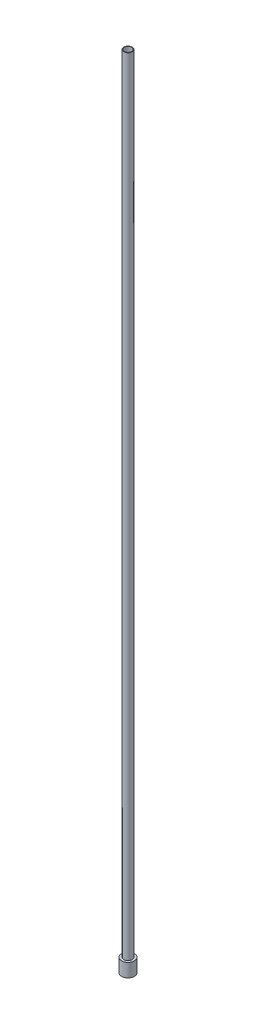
ISO-10303-21;
HEADER;
FILE_DESCRIPTION(('STEP AP214'),'2;1');
FILE_NAME('part.step','',(''),(''),'','','');
FILE_SCHEMA(('AUTOMOTIVE_DESIGN { 1 0 10303 214 1 1 1 1 }'));
ENDSEC;
DATA;
#1=APPLICATION_CONTEXT('core data for automotive mechanical design processes');
#2=APPLICATION_PROTOCOL_DEFINITION('international standard','automotive_design',2000,#1);
#3=PRODUCT_CONTEXT('',#1,'mechanical');
#4=PRODUCT('Part','Part','',(#3));
#5=PRODUCT_RELATED_PRODUCT_CATEGORY('part','',(#4));
#6=PRODUCT_DEFINITION_FORMATION('','',#4);
#7=PRODUCT_DEFINITION_CONTEXT('part definition',#1,'design');
#8=PRODUCT_DEFINITION('design','',#6,#7);
#9=PRODUCT_DEFINITION_SHAPE('','',#8);
#10=(LENGTH_UNIT() NAMED_UNIT(*) SI_UNIT(.MILLI.,.METRE.));
#11=(NAMED_UNIT(*) PLANE_ANGLE_UNIT() SI_UNIT($,.RADIAN.));
#12=(NAMED_UNIT(*) SI_UNIT($,.STERADIAN.) SOLID_ANGLE_UNIT());
#13=UNCERTAINTY_MEASURE_WITH_UNIT(LENGTH_MEASURE(1.E-05),#10,'distance_accuracy_value','');
#14=(GEOMETRIC_REPRESENTATION_CONTEXT(3) GLOBAL_UNCERTAINTY_ASSIGNED_CONTEXT((#13)) GLOBAL_UNIT_ASSIGNED_CONTEXT((#10,
#11,#12)) REPRESENTATION_CONTEXT('',''));
#15=CARTESIAN_POINT('',(0.,0.,0.));
#16=DIRECTION('',(0.,0.,1.));
#17=DIRECTION('',(1.,0.,0.));
#18=AXIS2_PLACEMENT_3D('',#15,#16,#17);
#19=CARTESIAN_POINT('',(0.,0.,0.));
#20=DIRECTION('',(0.,-1.,0.));
#21=DIRECTION('',(0.,0.,-1.));
#22=AXIS2_PLACEMENT_3D('',#19,#20,#21);
#23=CYLINDRICAL_SURFACE('',#22,1.3843);
#24=CARTESIAN_POINT('',(0.,304.8,0.));
#25=DIRECTION('',(0.,-1.,0.));
#26=DIRECTION('',(0.,0.,-1.));
#27=AXIS2_PLACEMENT_3D('',#24,#25,#26);
#28=CIRCLE('',#27,1.3843);
#29=CARTESIAN_POINT('',(0.,304.8,-1.3843));
#30=VERTEX_POINT('',#29);
#31=EDGE_CURVE('E52',#30,#30,#28,.T.);
#32=ORIENTED_EDGE('',*,*,#31,.F.);
#33=EDGE_LOOP('',(#32));
#34=FACE_BOUND('',#33,.T.);
#35=CARTESIAN_POINT('',(0.,0.,0.));
#36=DIRECTION('',(0.,-1.,0.));
#37=DIRECTION('',(0.,0.,-1.));
#38=AXIS2_PLACEMENT_3D('',#35,#36,#37);
#39=CIRCLE('',#38,1.3843);
#40=CARTESIAN_POINT('',(0.,0.,-1.3843));
#41=VERTEX_POINT('',#40);
#42=EDGE_CURVE('E10',#41,#41,#39,.T.);
#43=ORIENTED_EDGE('',*,*,#42,.T.);
#44=EDGE_LOOP('',(#43));
#45=FACE_BOUND('',#44,.T.);
#46=ADVANCED_FACE('F30',(#34,#45),#23,.F.);
#47=CARTESIAN_POINT('',(-1.3843,0.,0.));
#48=DIRECTION('',(0.,1.,0.));
#49=DIRECTION('',(0.,0.,1.));
#50=AXIS2_PLACEMENT_3D('',#47,#48,#49);
#51=PLANE('',#50);
#52=ORIENTED_EDGE('',*,*,#42,.F.);
#53=EDGE_LOOP('',(#52));
#54=FACE_BOUND('',#53,.T.);
#55=CARTESIAN_POINT('',(0.,0.,0.));
#56=DIRECTION('',(0.,-1.,0.));
#57=DIRECTION('',(0.,0.,-1.));
#58=AXIS2_PLACEMENT_3D('',#55,#56,#57);
#59=CIRCLE('',#58,2.413);
#60=CARTESIAN_POINT('',(0.,0.,-2.413));
#61=VERTEX_POINT('',#60);
#62=EDGE_CURVE('E36',#61,#61,#59,.T.);
#63=ORIENTED_EDGE('',*,*,#62,.T.);
#64=EDGE_LOOP('',(#63));
#65=FACE_BOUND('',#64,.T.);
#66=ADVANCED_FACE('F59',(#54,#65),#51,.F.);
#67=CARTESIAN_POINT('',(0.,0.,0.));
#68=DIRECTION('',(0.,-1.,0.));
#69=DIRECTION('',(0.,0.,-1.));
#70=AXIS2_PLACEMENT_3D('',#67,#68,#69);
#71=CYLINDRICAL_SURFACE('',#70,2.413);
#72=ORIENTED_EDGE('',*,*,#62,.F.);
#73=EDGE_LOOP('',(#72));
#74=FACE_BOUND('',#73,.T.);
#75=CARTESIAN_POINT('',(0.,5.1562,0.));
#76=DIRECTION('',(0.,-1.,0.));
#77=DIRECTION('',(0.,0.,-1.));
#78=AXIS2_PLACEMENT_3D('',#75,#76,#77);
#79=CIRCLE('',#78,2.413);
#80=CARTESIAN_POINT('',(0.,5.1562,-2.413));
#81=VERTEX_POINT('',#80);
#82=EDGE_CURVE('E40',#81,#81,#79,.T.);
#83=ORIENTED_EDGE('',*,*,#82,.T.);
#84=EDGE_LOOP('',(#83));
#85=FACE_BOUND('',#84,.T.);
#86=ADVANCED_FACE('F63',(#74,#85),#71,.T.);
#87=CARTESIAN_POINT('',(-2.413,5.1562,0.));
#88=DIRECTION('',(0.,-1.,0.));
#89=DIRECTION('',(0.,0.,-1.));
#90=AXIS2_PLACEMENT_3D('',#87,#88,#89);
#91=PLANE('',#90);
#92=ORIENTED_EDGE('',*,*,#82,.F.);
#93=EDGE_LOOP('',(#92));
#94=FACE_BOUND('',#93,.T.);
#95=CARTESIAN_POINT('',(0.,5.1562,0.));
#96=DIRECTION('',(0.,-1.,0.));
#97=DIRECTION('',(0.,0.,-1.));
#98=AXIS2_PLACEMENT_3D('',#95,#96,#97);
#99=CIRCLE('',#98,1.5875);
#100=CARTESIAN_POINT('',(0.,5.1562,-1.5875));
#101=VERTEX_POINT('',#100);
#102=EDGE_CURVE('E44',#101,#101,#99,.T.);
#103=ORIENTED_EDGE('',*,*,#102,.T.);
#104=EDGE_LOOP('',(#103));
#105=FACE_BOUND('',#104,.T.);
#106=ADVANCED_FACE('F68',(#94,#105),#91,.F.);
#107=CARTESIAN_POINT('',(0.,0.,0.));
#108=DIRECTION('',(0.,-1.,0.));
#109=DIRECTION('',(0.,0.,-1.));
#110=AXIS2_PLACEMENT_3D('',#107,#108,#109);
#111=CYLINDRICAL_SURFACE('',#110,1.5875);
#112=ORIENTED_EDGE('',*,*,#102,.F.);
#113=EDGE_LOOP('',(#112));
#114=FACE_BOUND('',#113,.T.);
#115=CARTESIAN_POINT('',(0.,304.8,0.));
#116=DIRECTION('',(0.,-1.,0.));
#117=DIRECTION('',(0.,0.,-1.));
#118=AXIS2_PLACEMENT_3D('',#115,#116,#117);
#119=CIRCLE('',#118,1.5875);
#120=CARTESIAN_POINT('',(0.,304.8,-1.5875));
#121=VERTEX_POINT('',#120);
#122=EDGE_CURVE('E49',#121,#121,#119,.T.);
#123=ORIENTED_EDGE('',*,*,#122,.T.);
#124=EDGE_LOOP('',(#123));
#125=FACE_BOUND('',#124,.T.);
#126=ADVANCED_FACE('F74',(#114,#125),#111,.T.);
#127=CARTESIAN_POINT('',(-1.5875,304.8,0.));
#128=DIRECTION('',(0.,-1.,0.));
#129=DIRECTION('',(0.,0.,-1.));
#130=AXIS2_PLACEMENT_3D('',#127,#128,#129);
#131=PLANE('',#130);
#132=ORIENTED_EDGE('',*,*,#122,.F.);
#133=EDGE_LOOP('',(#132));
#134=FACE_BOUND('',#133,.T.);
#135=ORIENTED_EDGE('',*,*,#31,.T.);
#136=EDGE_LOOP('',(#135));
#137=FACE_BOUND('',#136,.T.);
#138=ADVANCED_FACE('F56',(#134,#137),#131,.F.);
#139=CLOSED_SHELL('',(#46,#66,#86,#106,#126,#138));
#140=MANIFOLD_SOLID_BREP('B2',#139);
#141=ADVANCED_BREP_SHAPE_REPRESENTATION('',(#18,#140),#14);
#142=SHAPE_DEFINITION_REPRESENTATION(#9,#141);
ENDSEC;
END-ISO-10303-21;
